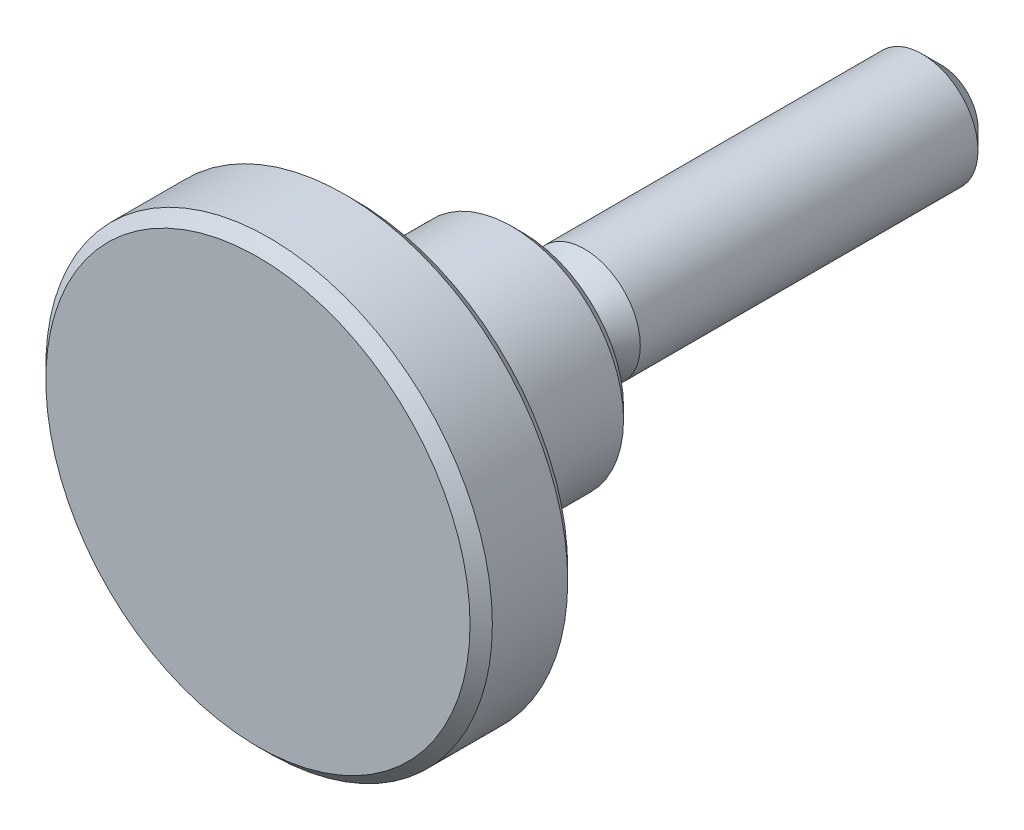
ISO-10303-21;
HEADER;
FILE_DESCRIPTION(('STEP AP214'),'2;1');
FILE_NAME('part.step','',(''),(''),'','','');
FILE_SCHEMA(('AUTOMOTIVE_DESIGN { 1 0 10303 214 1 1 1 1 }'));
ENDSEC;
DATA;
#1=APPLICATION_CONTEXT('core data for automotive mechanical design processes');
#2=APPLICATION_PROTOCOL_DEFINITION('international standard','automotive_design',2000,#1);
#3=PRODUCT_CONTEXT('',#1,'mechanical');
#4=PRODUCT('Part','Part','',(#3));
#5=PRODUCT_RELATED_PRODUCT_CATEGORY('part','',(#4));
#6=PRODUCT_DEFINITION_FORMATION('','',#4);
#7=PRODUCT_DEFINITION_CONTEXT('part definition',#1,'design');
#8=PRODUCT_DEFINITION('design','',#6,#7);
#9=PRODUCT_DEFINITION_SHAPE('','',#8);
#10=(LENGTH_UNIT() NAMED_UNIT(*) SI_UNIT(.MILLI.,.METRE.));
#11=(NAMED_UNIT(*) PLANE_ANGLE_UNIT() SI_UNIT($,.RADIAN.));
#12=(NAMED_UNIT(*) SI_UNIT($,.STERADIAN.) SOLID_ANGLE_UNIT());
#13=UNCERTAINTY_MEASURE_WITH_UNIT(LENGTH_MEASURE(1.E-05),#10,'distance_accuracy_value','');
#14=(GEOMETRIC_REPRESENTATION_CONTEXT(3) GLOBAL_UNCERTAINTY_ASSIGNED_CONTEXT((#13)) GLOBAL_UNIT_ASSIGNED_CONTEXT((#10,
#11,#12)) REPRESENTATION_CONTEXT('',''));
#15=CARTESIAN_POINT('',(0.,0.,0.));
#16=DIRECTION('',(0.,0.,1.));
#17=DIRECTION('',(1.,0.,0.));
#18=AXIS2_PLACEMENT_3D('',#15,#16,#17);
#19=CARTESIAN_POINT('',(0.,0.,-14.9999999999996));
#20=DIRECTION('',(0.,0.,1.));
#21=DIRECTION('',(1.,0.,0.));
#22=AXIS2_PLACEMENT_3D('',#19,#20,#21);
#23=PLANE('',#22);
#24=CARTESIAN_POINT('',(0.,0.,-14.9999999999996));
#25=DIRECTION('',(0.,0.,1.));
#26=DIRECTION('',(1.,0.,0.));
#27=AXIS2_PLACEMENT_3D('',#24,#25,#26);
#28=CIRCLE('',#27,1.30000383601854);
#29=CARTESIAN_POINT('',(1.30000383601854,0.,-14.9999999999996));
#30=VERTEX_POINT('',#29);
#31=EDGE_CURVE('E8',#30,#30,#28,.T.);
#32=ORIENTED_EDGE('',*,*,#31,.F.);
#33=EDGE_LOOP('',(#32));
#34=FACE_BOUND('',#33,.T.);
#35=ADVANCED_FACE('F12',(#34),#23,.F.);
#36=CARTESIAN_POINT('',(0.,0.,-14.9999999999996));
#37=DIRECTION('',(0.,0.,1.));
#38=DIRECTION('',(1.,0.,0.));
#39=AXIS2_PLACEMENT_3D('',#36,#37,#38);
#40=CONICAL_SURFACE('',#39,1.30000383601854,0.785398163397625);
#41=CARTESIAN_POINT('',(0.,0.,-14.3));
#42=DIRECTION('',(0.,0.,1.));
#43=DIRECTION('',(1.,0.,0.));
#44=AXIS2_PLACEMENT_3D('',#41,#42,#43);
#45=CIRCLE('',#44,2.0000038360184);
#46=CARTESIAN_POINT('',(2.0000038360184,0.,-14.3));
#47=VERTEX_POINT('',#46);
#48=EDGE_CURVE('E18',#47,#47,#45,.T.);
#49=ORIENTED_EDGE('',*,*,#48,.F.);
#50=EDGE_LOOP('',(#49));
#51=FACE_BOUND('',#50,.T.);
#52=ORIENTED_EDGE('',*,*,#31,.T.);
#53=EDGE_LOOP('',(#52));
#54=FACE_BOUND('',#53,.T.);
#55=ADVANCED_FACE('F132',(#51,#54),#40,.T.);
#56=CARTESIAN_POINT('',(0.,0.,12.));
#57=DIRECTION('',(0.,0.,1.));
#58=DIRECTION('',(1.,0.,0.));
#59=AXIS2_PLACEMENT_3D('',#56,#57,#58);
#60=CYLINDRICAL_SURFACE('',#59,2.00000383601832);
#61=CARTESIAN_POINT('',(0.,0.,-2.19999999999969));
#62=DIRECTION('',(0.,0.,1.));
#63=DIRECTION('',(1.,0.,0.));
#64=AXIS2_PLACEMENT_3D('',#61,#62,#63);
#65=CIRCLE('',#64,2.00000383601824);
#66=CARTESIAN_POINT('',(2.00000383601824,0.,-2.19999999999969));
#67=VERTEX_POINT('',#66);
#68=EDGE_CURVE('E22',#67,#67,#65,.T.);
#69=ORIENTED_EDGE('',*,*,#68,.F.);
#70=EDGE_LOOP('',(#69));
#71=FACE_BOUND('',#70,.T.);
#72=ORIENTED_EDGE('',*,*,#48,.T.);
#73=EDGE_LOOP('',(#72));
#74=FACE_BOUND('',#73,.T.);
#75=ADVANCED_FACE('F127',(#71,#74),#60,.T.);
#76=CARTESIAN_POINT('',(0.,0.,-2.19999999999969));
#77=DIRECTION('',(0.,0.,-1.));
#78=DIRECTION('',(-1.,0.,0.));
#79=AXIS2_PLACEMENT_3D('',#76,#77,#78);
#80=CONICAL_SURFACE('',#79,2.00000383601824,0.523598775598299);
#81=CARTESIAN_POINT('',(0.,0.,-1.33396795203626));
#82=DIRECTION('',(0.,0.,1.));
#83=DIRECTION('',(1.,0.,0.));
#84=AXIS2_PLACEMENT_3D('',#81,#82,#83);
#85=CIRCLE('',#84,1.49999999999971);
#86=CARTESIAN_POINT('',(1.49999999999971,0.,-1.33396795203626));
#87=VERTEX_POINT('',#86);
#88=EDGE_CURVE('E26',#87,#87,#85,.T.);
#89=ORIENTED_EDGE('',*,*,#88,.F.);
#90=EDGE_LOOP('',(#89));
#91=FACE_BOUND('',#90,.T.);
#92=ORIENTED_EDGE('',*,*,#68,.T.);
#93=EDGE_LOOP('',(#92));
#94=FACE_BOUND('',#93,.T.);
#95=ADVANCED_FACE('F121',(#91,#94),#80,.T.);
#96=CARTESIAN_POINT('',(0.,0.,12.));
#97=DIRECTION('',(0.,0.,1.));
#98=DIRECTION('',(1.,0.,0.));
#99=AXIS2_PLACEMENT_3D('',#96,#97,#98);
#100=CYLINDRICAL_SURFACE('',#99,1.49999999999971);
#101=CARTESIAN_POINT('',(0.,0.,-0.399999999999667));
#102=DIRECTION('',(0.,0.,1.));
#103=DIRECTION('',(1.,0.,0.));
#104=AXIS2_PLACEMENT_3D('',#101,#102,#103);
#105=CIRCLE('',#104,1.49999999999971);
#106=CARTESIAN_POINT('',(1.49999999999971,0.,-0.399999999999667));
#107=VERTEX_POINT('',#106);
#108=EDGE_CURVE('E31',#107,#107,#105,.T.);
#109=ORIENTED_EDGE('',*,*,#108,.F.);
#110=EDGE_LOOP('',(#109));
#111=FACE_BOUND('',#110,.T.);
#112=ORIENTED_EDGE('',*,*,#88,.T.);
#113=EDGE_LOOP('',(#112));
#114=FACE_BOUND('',#113,.T.);
#115=ADVANCED_FACE('F115',(#111,#114),#100,.T.);
#116=CARTESIAN_POINT('',(0.,0.,-0.399999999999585));
#117=DIRECTION('',(0.,0.,1.));
#118=DIRECTION('',(1.,0.,0.));
#119=AXIS2_PLACEMENT_3D('',#116,#117,#118);
#120=TOROIDAL_SURFACE('',#119,1.89999999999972,0.400000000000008);
#121=CARTESIAN_POINT('',(0.,0.,4.23272528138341E-13));
#122=DIRECTION('',(0.,0.,1.));
#123=DIRECTION('',(1.,0.,0.));
#124=AXIS2_PLACEMENT_3D('',#121,#122,#123);
#125=CIRCLE('',#124,1.89999999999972);
#126=CARTESIAN_POINT('',(1.89999999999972,0.,4.23272528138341E-13));
#127=VERTEX_POINT('',#126);
#128=EDGE_CURVE('E34',#127,#127,#125,.T.);
#129=ORIENTED_EDGE('',*,*,#128,.F.);
#130=EDGE_LOOP('',(#129));
#131=FACE_BOUND('',#130,.T.);
#132=ORIENTED_EDGE('',*,*,#108,.T.);
#133=EDGE_LOOP('',(#132));
#134=FACE_BOUND('',#133,.T.);
#135=ADVANCED_FACE('F109',(#131,#134),#120,.F.);
#136=CARTESIAN_POINT('',(0.,1.89999999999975,4.23016300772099E-13));
#137=DIRECTION('',(0.,0.,1.));
#138=DIRECTION('',(1.,0.,0.));
#139=AXIS2_PLACEMENT_3D('',#136,#137,#138);
#140=PLANE('',#139);
#141=CARTESIAN_POINT('',(0.,0.,4.23272528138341E-13));
#142=DIRECTION('',(0.,0.,1.));
#143=DIRECTION('',(1.,0.,0.));
#144=AXIS2_PLACEMENT_3D('',#141,#142,#143);
#145=CIRCLE('',#144,3.59999999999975);
#146=CARTESIAN_POINT('',(3.59999999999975,0.,4.23272528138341E-13));
#147=VERTEX_POINT('',#146);
#148=EDGE_CURVE('E37',#147,#147,#145,.T.);
#149=ORIENTED_EDGE('',*,*,#148,.F.);
#150=EDGE_LOOP('',(#149));
#151=FACE_BOUND('',#150,.T.);
#152=ORIENTED_EDGE('',*,*,#128,.T.);
#153=EDGE_LOOP('',(#152));
#154=FACE_BOUND('',#153,.T.);
#155=ADVANCED_FACE('F103',(#151,#154),#140,.F.);
#156=CARTESIAN_POINT('',(0.,0.,4.23272528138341E-13));
#157=DIRECTION('',(0.,0.,1.));
#158=DIRECTION('',(1.,0.,0.));
#159=AXIS2_PLACEMENT_3D('',#156,#157,#158);
#160=CONICAL_SURFACE('',#159,3.59999999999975,0.785398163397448);
#161=CARTESIAN_POINT('',(0.,0.,0.400000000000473));
#162=DIRECTION('',(0.,0.,1.));
#163=DIRECTION('',(1.,0.,0.));
#164=AXIS2_PLACEMENT_3D('',#161,#162,#163);
#165=CIRCLE('',#164,3.99999999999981);
#166=CARTESIAN_POINT('',(3.99999999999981,0.,0.400000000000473));
#167=VERTEX_POINT('',#166);
#168=EDGE_CURVE('E40',#167,#167,#165,.T.);
#169=ORIENTED_EDGE('',*,*,#168,.F.);
#170=EDGE_LOOP('',(#169));
#171=FACE_BOUND('',#170,.T.);
#172=ORIENTED_EDGE('',*,*,#148,.T.);
#173=EDGE_LOOP('',(#172));
#174=FACE_BOUND('',#173,.T.);
#175=ADVANCED_FACE('F97',(#171,#174),#160,.T.);
#176=CARTESIAN_POINT('',(0.,0.,12.));
#177=DIRECTION('',(0.,0.,1.));
#178=DIRECTION('',(1.,0.,0.));
#179=AXIS2_PLACEMENT_3D('',#176,#177,#178);
#180=CYLINDRICAL_SURFACE('',#179,3.99999999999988);
#181=CARTESIAN_POINT('',(0.,0.,5.50000000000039));
#182=DIRECTION('',(0.,0.,1.));
#183=DIRECTION('',(1.,0.,0.));
#184=AXIS2_PLACEMENT_3D('',#181,#182,#183);
#185=CIRCLE('',#184,3.99999999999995);
#186=CARTESIAN_POINT('',(3.99999999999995,0.,5.50000000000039));
#187=VERTEX_POINT('',#186);
#188=EDGE_CURVE('E43',#187,#187,#185,.T.);
#189=ORIENTED_EDGE('',*,*,#188,.F.);
#190=EDGE_LOOP('',(#189));
#191=FACE_BOUND('',#190,.T.);
#192=ORIENTED_EDGE('',*,*,#168,.T.);
#193=EDGE_LOOP('',(#192));
#194=FACE_BOUND('',#193,.T.);
#195=ADVANCED_FACE('F91',(#191,#194),#180,.T.);
#196=CARTESIAN_POINT('',(0.,0.,5.5));
#197=DIRECTION('',(0.,0.,1.));
#198=DIRECTION('',(1.,0.,0.));
#199=AXIS2_PLACEMENT_3D('',#196,#197,#198);
#200=TOROIDAL_SURFACE('',#199,4.50000000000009,0.500000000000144);
#201=CARTESIAN_POINT('',(0.,0.,6.));
#202=DIRECTION('',(0.,0.,1.));
#203=DIRECTION('',(1.,0.,0.));
#204=AXIS2_PLACEMENT_3D('',#201,#202,#203);
#205=CIRCLE('',#204,4.50000000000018);
#206=CARTESIAN_POINT('',(4.50000000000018,0.,6.));
#207=VERTEX_POINT('',#206);
#208=EDGE_CURVE('E46',#207,#207,#205,.T.);
#209=ORIENTED_EDGE('',*,*,#208,.F.);
#210=EDGE_LOOP('',(#209));
#211=FACE_BOUND('',#210,.T.);
#212=ORIENTED_EDGE('',*,*,#188,.T.);
#213=EDGE_LOOP('',(#212));
#214=FACE_BOUND('',#213,.T.);
#215=ADVANCED_FACE('F85',(#211,#214),#200,.F.);
#216=CARTESIAN_POINT('',(0.,4.50000000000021,6.));
#217=DIRECTION('',(0.,0.,1.));
#218=DIRECTION('',(1.,0.,0.));
#219=AXIS2_PLACEMENT_3D('',#216,#217,#218);
#220=PLANE('',#219);
#221=CARTESIAN_POINT('',(0.,0.,6.));
#222=DIRECTION('',(0.,0.,1.));
#223=DIRECTION('',(1.,0.,0.));
#224=AXIS2_PLACEMENT_3D('',#221,#222,#223);
#225=CIRCLE('',#224,7.6000000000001);
#226=CARTESIAN_POINT('',(7.6000000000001,0.,6.));
#227=VERTEX_POINT('',#226);
#228=EDGE_CURVE('E49',#227,#227,#225,.T.);
#229=ORIENTED_EDGE('',*,*,#228,.F.);
#230=EDGE_LOOP('',(#229));
#231=FACE_BOUND('',#230,.T.);
#232=ORIENTED_EDGE('',*,*,#208,.T.);
#233=EDGE_LOOP('',(#232));
#234=FACE_BOUND('',#233,.T.);
#235=ADVANCED_FACE('F79',(#231,#234),#220,.F.);
#236=CARTESIAN_POINT('',(0.,0.,6.));
#237=DIRECTION('',(0.,0.,1.));
#238=DIRECTION('',(1.,0.,0.));
#239=AXIS2_PLACEMENT_3D('',#236,#237,#238);
#240=CONICAL_SURFACE('',#239,7.6000000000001,0.785398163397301);
#241=CARTESIAN_POINT('',(0.,0.,6.4));
#242=DIRECTION('',(0.,0.,1.));
#243=DIRECTION('',(1.,0.,0.));
#244=AXIS2_PLACEMENT_3D('',#241,#242,#243);
#245=CIRCLE('',#244,8.);
#246=CARTESIAN_POINT('',(8.,0.,6.4));
#247=VERTEX_POINT('',#246);
#248=EDGE_CURVE('E52',#247,#247,#245,.T.);
#249=ORIENTED_EDGE('',*,*,#248,.F.);
#250=EDGE_LOOP('',(#249));
#251=FACE_BOUND('',#250,.T.);
#252=ORIENTED_EDGE('',*,*,#228,.T.);
#253=EDGE_LOOP('',(#252));
#254=FACE_BOUND('',#253,.T.);
#255=ADVANCED_FACE('F73',(#251,#254),#240,.T.);
#256=CARTESIAN_POINT('',(0.,0.,12.));
#257=DIRECTION('',(0.,0.,1.));
#258=DIRECTION('',(1.,0.,0.));
#259=AXIS2_PLACEMENT_3D('',#256,#257,#258);
#260=CYLINDRICAL_SURFACE('',#259,8.);
#261=CARTESIAN_POINT('',(0.,0.,9.1));
#262=DIRECTION('',(0.,0.,1.));
#263=DIRECTION('',(1.,0.,0.));
#264=AXIS2_PLACEMENT_3D('',#261,#262,#263);
#265=CIRCLE('',#264,8.);
#266=CARTESIAN_POINT('',(8.,0.,9.1));
#267=VERTEX_POINT('',#266);
#268=EDGE_CURVE('E55',#267,#267,#265,.T.);
#269=ORIENTED_EDGE('',*,*,#268,.F.);
#270=EDGE_LOOP('',(#269));
#271=FACE_BOUND('',#270,.T.);
#272=ORIENTED_EDGE('',*,*,#248,.T.);
#273=EDGE_LOOP('',(#272));
#274=FACE_BOUND('',#273,.T.);
#275=ADVANCED_FACE('F67',(#271,#274),#260,.T.);
#276=CARTESIAN_POINT('',(0.,0.,9.1));
#277=DIRECTION('',(0.,0.,-1.));
#278=DIRECTION('',(-1.,0.,0.));
#279=AXIS2_PLACEMENT_3D('',#276,#277,#278);
#280=CONICAL_SURFACE('',#279,8.,0.785398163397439);
#281=CARTESIAN_POINT('',(0.,0.,9.5));
#282=DIRECTION('',(0.,0.,1.));
#283=DIRECTION('',(1.,0.,0.));
#284=AXIS2_PLACEMENT_3D('',#281,#282,#283);
#285=CIRCLE('',#284,7.6);
#286=CARTESIAN_POINT('',(7.6,0.,9.5));
#287=VERTEX_POINT('',#286);
#288=EDGE_CURVE('E58',#287,#287,#285,.T.);
#289=ORIENTED_EDGE('',*,*,#288,.F.);
#290=EDGE_LOOP('',(#289));
#291=FACE_BOUND('',#290,.T.);
#292=ORIENTED_EDGE('',*,*,#268,.T.);
#293=EDGE_LOOP('',(#292));
#294=FACE_BOUND('',#293,.T.);
#295=ADVANCED_FACE('F64',(#291,#294),#280,.T.);
#296=CARTESIAN_POINT('',(0.,0.,9.5));
#297=DIRECTION('',(0.,0.,-1.));
#298=DIRECTION('',(-1.,0.,0.));
#299=AXIS2_PLACEMENT_3D('',#296,#297,#298);
#300=PLANE('',#299);
#301=ORIENTED_EDGE('',*,*,#288,.T.);
#302=EDGE_LOOP('',(#301));
#303=FACE_BOUND('',#302,.T.);
#304=ADVANCED_FACE('F62',(#303),#300,.F.);
#305=CLOSED_SHELL('',(#35,#55,#75,#95,#115,#135,#155,#175,#195,#215,#235,#255,#275,#295,#304));
#306=MANIFOLD_SOLID_BREP('B1',#305);
#307=ADVANCED_BREP_SHAPE_REPRESENTATION('',(#18,#306),#14);
#308=SHAPE_DEFINITION_REPRESENTATION(#9,#307);
ENDSEC;
END-ISO-10303-21;
